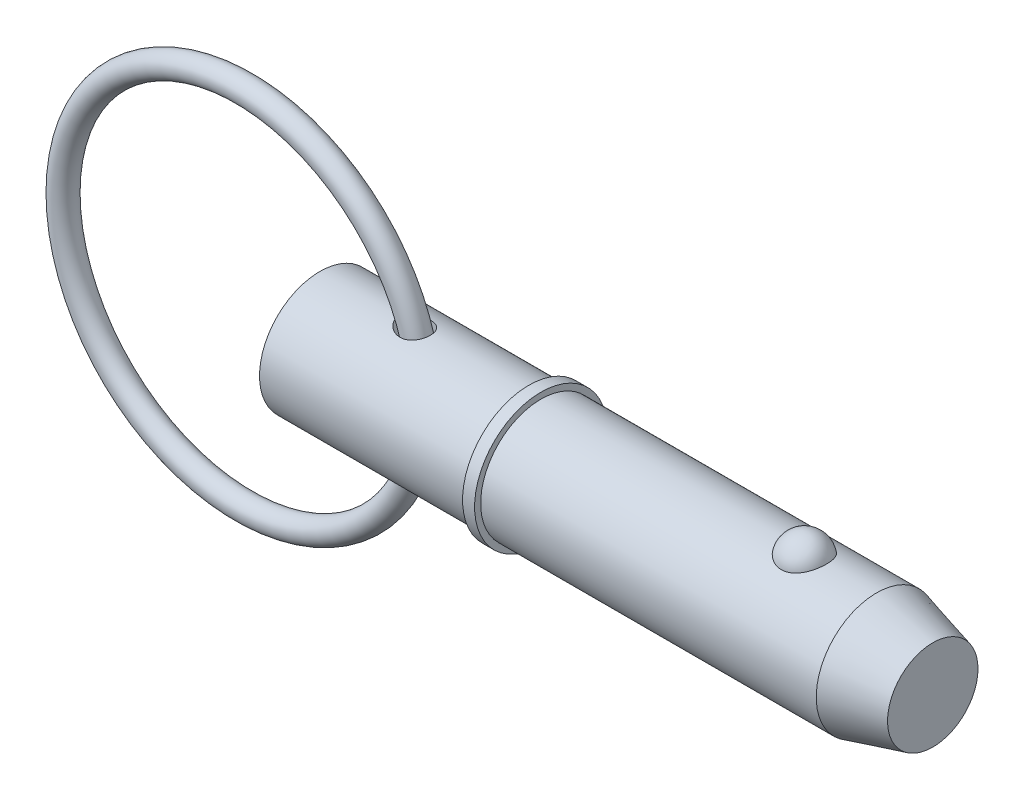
ISO-10303-21;
HEADER;
FILE_DESCRIPTION(('STEP AP214'),'2;1');
FILE_NAME('part.step','',(''),(''),'','','');
FILE_SCHEMA(('AUTOMOTIVE_DESIGN { 1 0 10303 214 1 1 1 1 }'));
ENDSEC;
DATA;
#1=APPLICATION_CONTEXT('core data for automotive mechanical design processes');
#2=APPLICATION_PROTOCOL_DEFINITION('international standard','automotive_design',2000,#1);
#3=PRODUCT_CONTEXT('',#1,'mechanical');
#4=PRODUCT('Part','Part','',(#3));
#5=PRODUCT_RELATED_PRODUCT_CATEGORY('part','',(#4));
#6=PRODUCT_DEFINITION_FORMATION('','',#4);
#7=PRODUCT_DEFINITION_CONTEXT('part definition',#1,'design');
#8=PRODUCT_DEFINITION('design','',#6,#7);
#9=PRODUCT_DEFINITION_SHAPE('','',#8);
#10=(LENGTH_UNIT() NAMED_UNIT(*) SI_UNIT(.MILLI.,.METRE.));
#11=(NAMED_UNIT(*) PLANE_ANGLE_UNIT() SI_UNIT($,.RADIAN.));
#12=(NAMED_UNIT(*) SI_UNIT($,.STERADIAN.) SOLID_ANGLE_UNIT());
#13=UNCERTAINTY_MEASURE_WITH_UNIT(LENGTH_MEASURE(1.E-05),#10,'distance_accuracy_value','');
#14=(GEOMETRIC_REPRESENTATION_CONTEXT(3) GLOBAL_UNCERTAINTY_ASSIGNED_CONTEXT((#13)) GLOBAL_UNIT_ASSIGNED_CONTEXT((#10,
#11,#12)) REPRESENTATION_CONTEXT('',''));
#15=CARTESIAN_POINT('',(0.,0.,0.));
#16=DIRECTION('',(0.,0.,1.));
#17=DIRECTION('',(1.,0.,0.));
#18=AXIS2_PLACEMENT_3D('',#15,#16,#17);
#19=CARTESIAN_POINT('',(-11.9894358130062,0.,0.));
#20=DIRECTION('',(0.,0.,1.));
#21=DIRECTION('',(1.,0.,0.));
#22=AXIS2_PLACEMENT_3D('',#19,#20,#21);
#23=TOROIDAL_SURFACE('',#22,28.575,1.905);
#24=CARTESIAN_POINT('',(18.4905641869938,0.,0.));
#25=VERTEX_POINT('',#24);
#26=VERTEX_LOOP('',#25);
#27=FACE_BOUND('',#26,.T.);
#28=ADVANCED_FACE('P0_F12',(#27),#23,.T.);
#29=CLOSED_SHELL('',(#28));
#30=MANIFOLD_SOLID_BREP('P0_B1',#29);
#31=CARTESIAN_POINT('',(0.,0.,0.));
#32=DIRECTION('',(1.,0.,0.));
#33=DIRECTION('',(0.,0.,-1.));
#34=AXIS2_PLACEMENT_3D('',#31,#32,#33);
#35=CYLINDRICAL_SURFACE('',#34,9.525);
#36=CARTESIAN_POINT('',(12.9513882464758,9.41921920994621,-1.41559473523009));
#37=CARTESIAN_POINT('',(13.0504692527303,9.40163924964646,-1.53256769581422));
#38=CARTESIAN_POINT('',(13.1602600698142,9.38319823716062,-1.6404459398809));
#39=CARTESIAN_POINT('',(13.3966485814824,9.34687220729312,-1.83618480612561));
#40=CARTESIAN_POINT('',(13.5232761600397,9.32898824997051,-1.92400906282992));
#41=CARTESIAN_POINT('',(13.78900694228,9.29593183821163,-2.07784697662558));
#42=CARTESIAN_POINT('',(13.9280753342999,9.28075215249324,-2.14391921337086));
#43=CARTESIAN_POINT('',(14.2153444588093,9.25488828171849,-2.25295850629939));
#44=CARTESIAN_POINT('',(14.3635415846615,9.24420233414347,-2.29593462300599));
#45=CARTESIAN_POINT('',(14.669669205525,9.22859713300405,-2.3579005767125));
#46=CARTESIAN_POINT('',(14.8277567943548,9.22385123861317,-2.37617053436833));
#47=CARTESIAN_POINT('',(15.1447573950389,9.22170813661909,-2.38448481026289));
#48=CARTESIAN_POINT('',(15.3036699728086,9.22430739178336,-2.3745427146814));
#49=CARTESIAN_POINT('',(15.6046561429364,9.2363636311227,-2.32717331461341));
#50=CARTESIAN_POINT('',(15.7470893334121,9.24528216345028,-2.29190131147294));
#51=CARTESIAN_POINT('',(16.0228763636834,9.26842607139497,-2.19642882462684));
#52=CARTESIAN_POINT('',(16.1562346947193,9.28264879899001,-2.1362407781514));
#53=CARTESIAN_POINT('',(16.3991522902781,9.31332263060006,-1.99805318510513));
#54=CARTESIAN_POINT('',(16.5097585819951,9.32951023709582,-1.92182839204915));
#55=CARTESIAN_POINT('',(16.7159974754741,9.36298467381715,-1.75147176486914));
#56=CARTESIAN_POINT('',(16.811631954,9.38027136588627,-1.65734217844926));
#57=CARTESIAN_POINT('',(16.9833240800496,9.41356881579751,-1.45618916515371));
#58=CARTESIAN_POINT('',(17.0597719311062,9.42959946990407,-1.34950141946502));
#59=CARTESIAN_POINT('',(17.1939538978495,9.45905380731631,-1.12462011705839));
#60=CARTESIAN_POINT('',(17.2516877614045,9.4724774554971,-1.00642640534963));
#61=CARTESIAN_POINT('',(17.3474400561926,9.49535683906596,-0.760990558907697));
#62=CARTESIAN_POINT('',(17.3853184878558,9.50478431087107,-0.633691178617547));
#63=CARTESIAN_POINT('',(17.4399027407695,9.51852575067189,-0.374363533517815));
#64=CARTESIAN_POINT('',(17.4566077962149,9.52283953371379,-0.242335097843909));
#65=CARTESIAN_POINT('',(17.4685150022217,9.52590431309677,0.0235692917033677));
#66=CARTESIAN_POINT('',(17.4635842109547,9.52462091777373,0.157451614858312));
#67=CARTESIAN_POINT('',(17.4320243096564,9.5165501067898,0.422467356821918));
#68=CARTESIAN_POINT('',(17.4053947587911,9.50976257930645,0.55360071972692));
#69=CARTESIAN_POINT('',(17.3310009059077,9.49140797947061,0.809490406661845));
#70=CARTESIAN_POINT('',(17.2832204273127,9.47983724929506,0.934241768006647));
#71=CARTESIAN_POINT('',(17.1676219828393,9.453180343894,1.1736825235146));
#72=CARTESIAN_POINT('',(17.0998044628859,9.43809424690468,1.28837214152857));
#73=CARTESIAN_POINT('',(16.9461013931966,9.40614962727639,1.50393386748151));
#74=CARTESIAN_POINT('',(16.8602910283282,9.38929862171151,1.6048606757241));
#75=CARTESIAN_POINT('',(16.6726759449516,9.35566510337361,1.79055313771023));
#76=CARTESIAN_POINT('',(16.5708731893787,9.33888258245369,1.87532077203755));
#77=CARTESIAN_POINT('',(16.3550631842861,9.30741331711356,2.02572386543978));
#78=CARTESIAN_POINT('',(16.2411701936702,9.29270956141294,2.09151983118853));
#79=CARTESIAN_POINT('',(16.0037488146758,9.26681293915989,2.20343355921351));
#80=CARTESIAN_POINT('',(15.8802207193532,9.25561996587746,2.24955191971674));
#81=CARTESIAN_POINT('',(15.6262451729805,9.23779438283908,2.32167613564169));
#82=CARTESIAN_POINT('',(15.4957570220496,9.23119272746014,2.34754561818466));
#83=CARTESIAN_POINT('',(15.2322153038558,9.22318493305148,2.37881082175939));
#84=CARTESIAN_POINT('',(15.0991611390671,9.22178001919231,2.38420171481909));
#85=CARTESIAN_POINT('',(14.8267609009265,9.22414647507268,2.37503099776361));
#86=CARTESIAN_POINT('',(14.6874545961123,9.22819578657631,2.35939810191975));
#87=CARTESIAN_POINT('',(14.412976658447,9.24129253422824,2.30756034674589));
#88=CARTESIAN_POINT('',(14.2778066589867,9.25034191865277,2.27134746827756));
#89=CARTESIAN_POINT('',(14.0027915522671,9.27334688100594,2.1756145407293));
#90=CARTESIAN_POINT('',(13.8635960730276,9.28766658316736,2.11431132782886));
#91=CARTESIAN_POINT('',(13.5969045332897,9.31925368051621,1.97041856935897));
#92=CARTESIAN_POINT('',(13.4694182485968,9.33652350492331,1.88781145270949));
#93=CARTESIAN_POINT('',(13.2243568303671,9.37286659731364,1.69844580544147));
#94=CARTESIAN_POINT('',(13.1075060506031,9.39198626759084,1.59075211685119));
#95=CARTESIAN_POINT('',(12.8957171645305,9.42881110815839,1.35544651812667));
#96=CARTESIAN_POINT('',(12.8007455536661,9.44651841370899,1.22786557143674));
#97=CARTESIAN_POINT('',(12.6580495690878,9.4741137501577,0.9887243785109));
#98=CARTESIAN_POINT('',(12.604453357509,9.4848570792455,0.880756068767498));
#99=CARTESIAN_POINT('',(12.515693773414,9.50295777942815,0.657225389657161));
#100=CARTESIAN_POINT('',(12.4805142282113,9.51031812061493,0.541669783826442));
#101=CARTESIAN_POINT('',(12.4305797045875,9.52083647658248,0.305475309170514));
#102=CARTESIAN_POINT('',(12.4159122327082,9.52397648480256,0.18481691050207));
#103=CARTESIAN_POINT('',(12.408320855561,9.52559626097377,-0.0572308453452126));
#104=CARTESIAN_POINT('',(12.4153963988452,9.52407614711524,-0.178620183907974));
#105=CARTESIAN_POINT('',(12.4495068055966,9.51684301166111,-0.409566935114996));
#106=CARTESIAN_POINT('',(12.4750931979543,9.51143444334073,-0.519353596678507));
#107=CARTESIAN_POINT('',(12.543120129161,9.49733710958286,-0.73328523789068));
#108=CARTESIAN_POINT('',(12.5855568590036,9.4886490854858,-0.837431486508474));
#109=CARTESIAN_POINT('',(12.6780792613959,9.47023833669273,-1.02356028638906));
#110=CARTESIAN_POINT('',(12.7261842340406,9.46084463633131,-1.10657511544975));
#111=CARTESIAN_POINT('',(12.8319313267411,9.44081892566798,-1.26610577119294));
#112=CARTESIAN_POINT('',(12.8895756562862,9.43018662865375,-1.34262008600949));
#113=CARTESIAN_POINT('',(12.9513882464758,9.41921920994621,-1.41559473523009));
#114=B_SPLINE_CURVE_WITH_KNOTS('',3,(#36,#37,#38,#39,#40,#41,#42,#43,#44,#45,#46,#47,#48,#49,
#50,#51,#52,#53,#54,#55,#56,#57,#58,#59,#60,#61,#62,#63,#64,#65,#66,#67,#68,#69,#70,#71,#72,#73,
#74,#75,#76,#77,#78,#79,#80,#81,#82,#83,#84,#85,#86,#87,#88,#89,#90,#91,#92,#93,#94,#95,#96,#97,
#98,#99,#100,#101,#102,#103,#104,#105,#106,#107,#108,#109,#110,#111,#112,#113),.UNSPECIFIED.,
.T.,.F.,(4,2,2,2,2,2,2,2,2,2,2,2,2,2,2,2,2,2,2,2,2,2,2,2,2,2,2,2,2,2,2,2,2,2,2,2,2,2,4),(0.,
0.462524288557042,0.925880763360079,1.3879789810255,1.8498957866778,2.3250010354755,
2.79987752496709,3.23851602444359,3.67693583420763,4.08084875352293,4.48471100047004,
4.87953549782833,5.27436531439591,5.67194282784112,6.0695347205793,6.46957303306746,
6.86961947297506,7.26997240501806,7.67031642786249,8.06901977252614,8.46767421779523,
8.86284969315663,9.25801315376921,9.65581560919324,10.0537118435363,10.4726706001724,
10.8917927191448,11.3481090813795,11.8048030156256,12.2824769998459,12.7594145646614,
13.1209614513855,13.4821903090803,13.8449555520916,14.2077115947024,14.5447865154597,
14.881785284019,15.170268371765,15.4588183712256),.UNSPECIFIED.);
#115=CARTESIAN_POINT('',(12.9513882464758,9.41921920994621,-1.41559473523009));
#116=VERTEX_POINT('',#115);
#117=EDGE_CURVE('P1_E42',#116,#116,#114,.T.);
#118=ORIENTED_EDGE('',*,*,#117,.T.);
#119=EDGE_LOOP('',(#118));
#120=FACE_BOUND('',#119,.T.);
#121=CARTESIAN_POINT('',(0.,0.,0.));
#122=DIRECTION('',(1.,0.,0.));
#123=DIRECTION('',(0.,0.,-1.));
#124=AXIS2_PLACEMENT_3D('',#121,#122,#123);
#125=CIRCLE('',#124,9.525);
#126=CARTESIAN_POINT('',(0.,0.,-9.525));
#127=VERTEX_POINT('',#126);
#128=EDGE_CURVE('P1_E9',#127,#127,#125,.T.);
#129=ORIENTED_EDGE('',*,*,#128,.T.);
#130=EDGE_LOOP('',(#129));
#131=FACE_BOUND('',#130,.T.);
#132=CARTESIAN_POINT('',(33.025,0.,0.));
#133=DIRECTION('',(1.,0.,0.));
#134=DIRECTION('',(0.,0.,-1.));
#135=AXIS2_PLACEMENT_3D('',#132,#133,#134);
#136=CIRCLE('',#135,9.525);
#137=CARTESIAN_POINT('',(33.025,0.,-9.525));
#138=VERTEX_POINT('',#137);
#139=EDGE_CURVE('P1_E25',#138,#138,#136,.T.);
#140=ORIENTED_EDGE('',*,*,#139,.F.);
#141=EDGE_LOOP('',(#140));
#142=FACE_BOUND('',#141,.T.);
#143=CARTESIAN_POINT('',(12.9513882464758,-9.41921920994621,-1.41559473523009));
#144=CARTESIAN_POINT('',(12.8706569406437,-9.43354320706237,-1.32028288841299));
#145=CARTESIAN_POINT('',(12.7970077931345,-9.44729974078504,-1.21890449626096));
#146=CARTESIAN_POINT('',(12.6667099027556,-9.47239055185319,-1.00546491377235));
#147=CARTESIAN_POINT('',(12.6100480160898,-9.48372669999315,-0.893412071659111));
#148=CARTESIAN_POINT('',(12.5163428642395,-9.50281544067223,-0.66020233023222));
#149=CARTESIAN_POINT('',(12.4794216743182,-9.51054569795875,-0.538993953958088));
#150=CARTESIAN_POINT('',(12.4282252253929,-9.52133525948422,-0.29167282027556));
#151=CARTESIAN_POINT('',(12.4139371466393,-9.52439720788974,-0.165562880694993));
#152=CARTESIAN_POINT('',(12.4092595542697,-9.52539668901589,0.0763263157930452));
#153=CARTESIAN_POINT('',(12.4169377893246,-9.5237485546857,0.192070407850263));
#154=CARTESIAN_POINT('',(12.4515961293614,-9.51640070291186,0.420478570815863));
#155=CARTESIAN_POINT('',(12.4785770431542,-9.51070081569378,0.533142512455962));
#156=CARTESIAN_POINT('',(12.5496371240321,-9.49599978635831,0.750537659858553));
#157=CARTESIAN_POINT('',(12.5934215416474,-9.48705569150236,0.855370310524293));
#158=CARTESIAN_POINT('',(12.6960201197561,-9.46670226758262,1.05710432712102));
#159=CARTESIAN_POINT('',(12.754838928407,-9.45529217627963,1.15400322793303));
#160=CARTESIAN_POINT('',(12.8926588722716,-9.42958102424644,1.34883014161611));
#161=CARTESIAN_POINT('',(12.9731843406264,-9.41509922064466,1.44565277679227));
#162=CARTESIAN_POINT('',(13.1473692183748,-9.38554264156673,1.62653953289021));
#163=CARTESIAN_POINT('',(13.2410364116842,-9.37046751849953,1.71059603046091));
#164=CARTESIAN_POINT('',(13.4543924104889,-9.33867330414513,1.87697964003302));
#165=CARTESIAN_POINT('',(13.5758667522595,-9.32205896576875,1.95704323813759));
#166=CARTESIAN_POINT('',(13.8299208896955,-9.29140277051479,2.09777392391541));
#167=CARTESIAN_POINT('',(13.9625074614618,-9.27736250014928,2.15842906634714));
#168=CARTESIAN_POINT('',(14.2477938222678,-9.25234849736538,2.26337318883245));
#169=CARTESIAN_POINT('',(14.4012368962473,-9.2417532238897,2.30575283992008));
#170=CARTESIAN_POINT('',(14.7134258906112,-9.22706044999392,2.36387471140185));
#171=CARTESIAN_POINT('',(14.8721705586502,-9.22296142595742,2.37962317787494));
#172=CARTESIAN_POINT('',(15.1841930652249,-9.22219798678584,2.38258156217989));
#173=CARTESIAN_POINT('',(15.3374581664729,-9.22526675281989,2.37081567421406));
#174=CARTESIAN_POINT('',(15.6390558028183,-9.23821642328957,2.31984408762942));
#175=CARTESIAN_POINT('',(15.7873916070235,-9.24809271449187,2.28065697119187));
#176=CARTESIAN_POINT('',(16.0605055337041,-9.27231045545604,2.17997072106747));
#177=CARTESIAN_POINT('',(16.1861988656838,-9.28616347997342,2.12082794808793));
#178=CARTESIAN_POINT('',(16.4248737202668,-9.31689725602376,1.9814435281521));
#179=CARTESIAN_POINT('',(16.5378583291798,-9.33377726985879,1.90120701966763));
#180=CARTESIAN_POINT('',(16.7424913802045,-9.36766057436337,1.72629138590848));
#181=CARTESIAN_POINT('',(16.8349077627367,-9.38461836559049,1.63249912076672));
#182=CARTESIAN_POINT('',(17.0025959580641,-9.41752009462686,1.43052052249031));
#183=CARTESIAN_POINT('',(17.0778684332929,-9.43346407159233,1.32233474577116));
#184=CARTESIAN_POINT('',(17.2093311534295,-9.46256896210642,1.09477833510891));
#185=CARTESIAN_POINT('',(17.2655443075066,-9.47573320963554,0.975421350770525));
#186=CARTESIAN_POINT('',(17.3577240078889,-9.49788660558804,0.728764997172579));
#187=CARTESIAN_POINT('',(17.3936897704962,-9.5068755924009,0.601465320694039));
#188=CARTESIAN_POINT('',(17.4447894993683,-9.51977728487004,0.341392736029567));
#189=CARTESIAN_POINT('',(17.4597470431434,-9.52364698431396,0.208583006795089));
#190=CARTESIAN_POINT('',(17.467935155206,-9.52575588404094,-0.0577507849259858));
#191=CARTESIAN_POINT('',(17.4611651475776,-9.52399493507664,-0.191274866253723));
#192=CARTESIAN_POINT('',(17.4259933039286,-9.51501704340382,-0.455658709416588));
#193=CARTESIAN_POINT('',(17.3975278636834,-9.50778405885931,-0.586509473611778));
#194=CARTESIAN_POINT('',(17.3195245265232,-9.48862442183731,-0.841413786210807));
#195=CARTESIAN_POINT('',(17.2699864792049,-9.47669773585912,-0.965467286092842));
#196=CARTESIAN_POINT('',(17.1510794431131,-9.44947793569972,-1.20302860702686));
#197=CARTESIAN_POINT('',(17.0817421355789,-9.43419020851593,-1.31655289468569));
#198=CARTESIAN_POINT('',(16.9249035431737,-9.40193593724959,-1.52999797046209));
#199=CARTESIAN_POINT('',(16.8374037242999,-9.38496952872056,-1.62991985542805));
#200=CARTESIAN_POINT('',(16.6472525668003,-9.35139745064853,-1.81261591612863));
#201=CARTESIAN_POINT('',(16.544718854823,-9.33479003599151,-1.89551219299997));
#202=CARTESIAN_POINT('',(16.3268885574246,-9.30366076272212,-2.04284430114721));
#203=CARTESIAN_POINT('',(16.2115933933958,-9.28913867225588,-2.10728218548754));
#204=CARTESIAN_POINT('',(15.9721327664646,-9.26380878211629,-2.21598517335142));
#205=CARTESIAN_POINT('',(15.8480095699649,-9.25298455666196,-2.26033977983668));
#206=CARTESIAN_POINT('',(15.5939970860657,-9.23601616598,-2.32870721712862));
#207=CARTESIAN_POINT('',(15.4641070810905,-9.22987258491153,-2.35271750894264));
#208=CARTESIAN_POINT('',(15.1982340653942,-9.22261892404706,-2.38099747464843));
#209=CARTESIAN_POINT('',(15.0621840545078,-9.22166165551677,-2.38466791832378));
#210=CARTESIAN_POINT('',(14.7911713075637,-9.22504733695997,-2.37153091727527));
#211=CARTESIAN_POINT('',(14.6562088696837,-9.2293916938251,-2.35471803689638));
#212=CARTESIAN_POINT('',(14.3799999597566,-9.24325361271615,-2.29972931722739));
#213=CARTESIAN_POINT('',(14.2390842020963,-9.25314817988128,-2.2599897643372));
#214=CARTESIAN_POINT('',(13.9651910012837,-9.27709186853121,-2.15959208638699));
#215=CARTESIAN_POINT('',(13.8322212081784,-9.29114491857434,-2.09891417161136));
#216=CARTESIAN_POINT('',(13.5621642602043,-9.32369066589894,-1.94960068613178));
#217=CARTESIAN_POINT('',(13.4264724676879,-9.34251276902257,-1.85849626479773));
#218=CARTESIAN_POINT('',(13.1736579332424,-9.38095091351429,-1.6535412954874));
#219=CARTESIAN_POINT('',(13.0565182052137,-9.40056620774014,-1.53971177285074));
#220=CARTESIAN_POINT('',(12.9513882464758,-9.41921920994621,-1.41559473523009));
#221=B_SPLINE_CURVE_WITH_KNOTS('',3,(#143,#144,#145,#146,#147,#148,#149,#150,#151,#152,#153,
#154,#155,#156,#157,#158,#159,#160,#161,#162,#163,#164,#165,#166,#167,#168,#169,#170,#171,#172,
#173,#174,#175,#176,#177,#178,#179,#180,#181,#182,#183,#184,#185,#186,#187,#188,#189,#190,#191,
#192,#193,#194,#195,#196,#197,#198,#199,#200,#201,#202,#203,#204,#205,#206,#207,#208,#209,#210,
#211,#212,#213,#214,#215,#216,#217,#218,#219,#220),.UNSPECIFIED.,.T.,.F.,(4,2,2,2,2,2,2,2,2,2,2,
2,2,2,2,2,2,2,2,2,2,2,2,2,2,2,2,2,2,2,2,2,2,2,2,2,2,2,4),(0.,0.376746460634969,0.75320065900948,
1.13195666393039,1.51049805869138,1.85679105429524,2.20309856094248,2.54359033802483,
2.88418751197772,3.26301611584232,3.64207005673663,4.07954912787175,4.51729693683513,
4.99355673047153,5.46970480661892,5.92841231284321,6.38680927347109,6.80346940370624,
7.22002812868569,7.61642768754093,8.01281192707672,8.40871801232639,8.80463942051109,
9.20386620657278,9.60310357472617,10.0035159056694,10.4039310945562,10.8037091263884,
11.2034549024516,11.6002252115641,11.9969513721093,12.3918916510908,12.7868812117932,
13.1934480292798,13.6001227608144,14.038511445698,14.4773156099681,14.9683748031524,
15.4589817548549),.UNSPECIFIED.);
#222=CARTESIAN_POINT('',(12.9513882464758,-9.41921920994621,-1.41559473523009));
#223=VERTEX_POINT('',#222);
#224=EDGE_CURVE('P1_E17',#223,#223,#221,.T.);
#225=ORIENTED_EDGE('',*,*,#224,.T.);
#226=EDGE_LOOP('',(#225));
#227=FACE_BOUND('',#226,.T.);
#228=ADVANCED_FACE('P1_F13',(#120,#131,#142,#227),#35,.T.);
#229=CARTESIAN_POINT('',(0.,0.,0.));
#230=DIRECTION('',(1.,0.,0.));
#231=DIRECTION('',(0.,0.,-1.));
#232=AXIS2_PLACEMENT_3D('',#229,#230,#231);
#233=CYLINDRICAL_SURFACE('',#232,9.525);
#234=CARTESIAN_POINT('',(87.9430540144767,0.,0.));
#235=DIRECTION('',(1.,0.,0.));
#236=DIRECTION('',(0.,0.,-1.));
#237=AXIS2_PLACEMENT_3D('',#234,#235,#236);
#238=CIRCLE('',#237,9.525);
#239=CARTESIAN_POINT('',(87.9430540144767,0.,-9.525));
#240=VERTEX_POINT('',#239);
#241=EDGE_CURVE('P1_E99',#240,#240,#238,.T.);
#242=ORIENTED_EDGE('',*,*,#241,.F.);
#243=EDGE_LOOP('',(#242));
#244=FACE_BOUND('',#243,.T.);
#245=CARTESIAN_POINT('',(34.93,0.,0.));
#246=DIRECTION('',(1.,0.,0.));
#247=DIRECTION('',(0.,0.,-1.));
#248=AXIS2_PLACEMENT_3D('',#245,#246,#247);
#249=CIRCLE('',#248,9.525);
#250=CARTESIAN_POINT('',(34.93,0.,-9.525));
#251=VERTEX_POINT('',#250);
#252=EDGE_CURVE('P1_E96',#251,#251,#249,.T.);
#253=ORIENTED_EDGE('',*,*,#252,.T.);
#254=EDGE_LOOP('',(#253));
#255=FACE_BOUND('',#254,.T.);
#256=CARTESIAN_POINT('',(76.5457573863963,8.80405803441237,3.63513233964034));
#257=CARTESIAN_POINT('',(76.4516766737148,8.80405953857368,3.63513053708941));
#258=CARTESIAN_POINT('',(76.3575618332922,8.80561325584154,3.63137461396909));
#259=CARTESIAN_POINT('',(76.1700126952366,8.81177748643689,3.61638665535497));
#260=CARTESIAN_POINT('',(76.0765788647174,8.81638992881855,3.60514990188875));
#261=CARTESIAN_POINT('',(75.7979452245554,8.83467114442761,3.56024627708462));
#262=CARTESIAN_POINT('',(75.6146916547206,8.85278327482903,3.5153862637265));
#263=CARTESIAN_POINT('',(75.259509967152,8.89871214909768,3.39742145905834));
#264=CARTESIAN_POINT('',(75.0875533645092,8.92650327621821,3.32439116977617));
#265=CARTESIAN_POINT('',(74.758707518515,8.98874819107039,3.15220244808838));
#266=CARTESIAN_POINT('',(74.6018114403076,9.02319893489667,3.05305594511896));
#267=CARTESIAN_POINT('',(74.3022147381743,9.09629186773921,2.82797815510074));
#268=CARTESIAN_POINT('',(74.1600600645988,9.13502685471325,2.70135138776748));
#269=CARTESIAN_POINT('',(73.8982999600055,9.2118657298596,2.42641932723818));
#270=CARTESIAN_POINT('',(73.7787015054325,9.24996941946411,2.27810735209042));
#271=CARTESIAN_POINT('',(73.559645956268,9.32341082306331,1.95652290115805));
#272=CARTESIAN_POINT('',(73.4613174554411,9.35855090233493,1.78243511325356));
#273=CARTESIAN_POINT('',(73.2938190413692,9.42045142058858,1.41937246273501));
#274=CARTESIAN_POINT('',(73.2246511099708,9.44721128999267,1.23039658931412));
#275=CARTESIAN_POINT('',(73.1161994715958,9.48990641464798,0.84037088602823));
#276=CARTESIAN_POINT('',(73.0772880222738,9.50570658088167,0.639202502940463));
#277=CARTESIAN_POINT('',(73.0315550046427,9.52433146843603,0.23266436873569));
#278=CARTESIAN_POINT('',(73.0247324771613,9.52715657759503,0.0272947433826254));
#279=CARTESIAN_POINT('',(73.043255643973,9.51956918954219,-0.380478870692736));
#280=CARTESIAN_POINT('',(73.0684052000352,9.50923740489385,-0.582893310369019));
#281=CARTESIAN_POINT('',(73.1500253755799,9.47651897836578,-0.980293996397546));
#282=CARTESIAN_POINT('',(73.2064966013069,9.45413210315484,-1.17528009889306));
#283=CARTESIAN_POINT('',(73.3497192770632,9.39954044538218,-1.55263697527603));
#284=CARTESIAN_POINT('',(73.4365124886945,9.36732213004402,-1.73498993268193));
#285=CARTESIAN_POINT('',(73.6386103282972,9.29640700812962,-2.08177763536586));
#286=CARTESIAN_POINT('',(73.7539172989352,9.25770966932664,-2.24621090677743));
#287=CARTESIAN_POINT('',(74.011264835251,9.17775604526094,-2.5533833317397));
#288=CARTESIAN_POINT('',(74.1534344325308,9.136488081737,-2.696011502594));
#289=CARTESIAN_POINT('',(74.46089985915,9.05620497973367,-2.95451229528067));
#290=CARTESIAN_POINT('',(74.626193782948,9.01718965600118,-3.070387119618));
#291=CARTESIAN_POINT('',(74.972052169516,8.94680019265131,-3.26976836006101));
#292=CARTESIAN_POINT('',(75.1522278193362,8.91528408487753,-3.353897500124));
#293=CARTESIAN_POINT('',(75.5256514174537,8.86272514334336,-3.49043503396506));
#294=CARTESIAN_POINT('',(75.718894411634,8.84167836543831,-3.54285537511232));
#295=CARTESIAN_POINT('',(76.1025036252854,8.81348056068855,-3.61241306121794));
#296=CARTESIAN_POINT('',(76.2925251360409,8.80568348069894,-3.6311933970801));
#297=CARTESIAN_POINT('',(76.6731906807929,8.80289410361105,-3.63795342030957));
#298=CARTESIAN_POINT('',(76.8638345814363,8.80789922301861,-3.62593932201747));
#299=CARTESIAN_POINT('',(77.234007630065,8.82974915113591,-3.57238430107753));
#300=CARTESIAN_POINT('',(77.4136976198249,8.84621463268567,-3.53178890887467));
#301=CARTESIAN_POINT('',(77.7634226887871,8.88875330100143,-3.42331083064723));
#302=CARTESIAN_POINT('',(77.9334569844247,8.91482726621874,-3.35542593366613));
#303=CARTESIAN_POINT('',(78.2632377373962,8.97448239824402,-3.19248225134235));
#304=CARTESIAN_POINT('',(78.4226801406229,9.00821446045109,-3.0968647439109));
#305=CARTESIAN_POINT('',(78.7235136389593,9.07935398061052,-2.88162736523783));
#306=CARTESIAN_POINT('',(78.8649005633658,9.11676228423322,-2.76200196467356));
#307=CARTESIAN_POINT('',(79.1333193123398,9.19347419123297,-2.49516285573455));
#308=CARTESIAN_POINT('',(79.2592750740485,9.23277872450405,-2.34686614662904));
#309=CARTESIAN_POINT('',(79.4855227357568,9.3073761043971,-2.03093683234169));
#310=CARTESIAN_POINT('',(79.5858100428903,9.34266823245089,-1.86330077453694));
#311=CARTESIAN_POINT('',(79.7615149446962,9.40674710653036,-1.50744893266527));
#312=CARTESIAN_POINT('',(79.836041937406,9.43529176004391,-1.31874876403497));
#313=CARTESIAN_POINT('',(79.9541650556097,9.48144132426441,-0.930631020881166));
#314=CARTESIAN_POINT('',(79.9977608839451,9.49904612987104,-0.73121334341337));
#315=CARTESIAN_POINT('',(80.0531580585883,9.5215314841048,-0.327147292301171));
#316=CARTESIAN_POINT('',(80.0649354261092,9.52640243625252,-0.12249509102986));
#317=CARTESIAN_POINT('',(80.0563825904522,9.5228957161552,0.286018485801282));
#318=CARTESIAN_POINT('',(80.0360530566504,9.5145183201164,0.489879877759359));
#319=CARTESIAN_POINT('',(79.9638840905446,9.48544083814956,0.889994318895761));
#320=CARTESIAN_POINT('',(79.9121993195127,9.46480124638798,1.08627971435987));
#321=CARTESIAN_POINT('',(79.7784917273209,9.41333895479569,1.46682086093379));
#322=CARTESIAN_POINT('',(79.6964668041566,9.38251554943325,1.65107577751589));
#323=CARTESIAN_POINT('',(79.5031929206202,9.31365636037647,2.00346348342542));
#324=CARTESIAN_POINT('',(79.3917838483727,9.27558138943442,2.17150083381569));
#325=CARTESIAN_POINT('',(79.1422947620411,9.19638714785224,2.48563115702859));
#326=CARTESIAN_POINT('',(79.0042163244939,9.15526805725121,2.63172542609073));
#327=CARTESIAN_POINT('',(78.7048438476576,9.07465393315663,2.89750997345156));
#328=CARTESIAN_POINT('',(78.5436109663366,9.03515496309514,3.01726776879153));
#329=CARTESIAN_POINT('',(78.2016136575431,8.96227564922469,3.22732920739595));
#330=CARTESIAN_POINT('',(78.020841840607,8.92889763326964,3.31762165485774));
#331=CARTESIAN_POINT('',(77.6514451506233,8.8734538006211,3.46314419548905));
#332=CARTESIAN_POINT('',(77.4633237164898,8.85102983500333,3.51950082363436));
#333=CARTESIAN_POINT('',(77.1757869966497,8.8266696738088,3.57993683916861));
#334=CARTESIAN_POINT('',(77.0791339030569,8.82009725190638,3.5960621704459));
#335=CARTESIAN_POINT('',(76.8846770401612,8.81020897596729,3.62022512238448));
#336=CARTESIAN_POINT('',(76.7868741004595,8.80689090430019,3.62826825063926));
#337=CARTESIAN_POINT('',(76.6412243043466,8.80445615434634,3.63416760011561));
#338=CARTESIAN_POINT('',(76.5934952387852,8.80405727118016,3.63513325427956));
#339=CARTESIAN_POINT('',(76.5457573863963,8.80405803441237,3.63513233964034));
#340=B_SPLINE_CURVE_WITH_KNOTS('',3,(#256,#257,#258,#259,#260,#261,#262,#263,#264,#265,#266,
#267,#268,#269,#270,#271,#272,#273,#274,#275,#276,#277,#278,#279,#280,#281,#282,#283,#284,#285,
#286,#287,#288,#289,#290,#291,#292,#293,#294,#295,#296,#297,#298,#299,#300,#301,#302,#303,#304,
#305,#306,#307,#308,#309,#310,#311,#312,#313,#314,#315,#316,#317,#318,#319,#320,#321,#322,#323,
#324,#325,#326,#327,#328,#329,#330,#331,#332,#333,#334,#335,#336,#337,#338,#339),.UNSPECIFIED.,
.T.,.F.,(4,2,2,2,2,2,2,2,2,2,2,2,2,2,2,2,2,2,2,2,2,2,2,2,2,2,2,2,2,2,2,2,2,2,2,2,2,2,2,2,2,4),
(0.,0.282202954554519,0.564584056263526,1.13017050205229,1.69427128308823,2.25811483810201,
2.83836627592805,3.4187968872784,4.02497117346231,4.63118665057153,5.24474754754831,
5.85829010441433,6.46808687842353,7.07789545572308,7.68854723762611,8.29924920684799,
8.9129628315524,9.52662591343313,10.1275338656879,10.7282152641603,11.2986646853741,
11.8689989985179,12.4213015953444,12.973648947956,13.5380053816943,14.1024919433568,
14.695298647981,15.2882113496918,15.8999469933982,16.5116885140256,17.1238909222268,
17.7360805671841,18.3452748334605,18.9545113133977,19.567138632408,20.179729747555,
20.7907316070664,21.4019653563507,21.9915938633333,22.2859053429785,22.5800161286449,
22.7232098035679),.UNSPECIFIED.);
#341=CARTESIAN_POINT('',(76.5457573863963,8.80405803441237,3.63513233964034));
#342=VERTEX_POINT('',#341);
#343=EDGE_CURVE('P1_E34',#342,#342,#340,.T.);
#344=ORIENTED_EDGE('',*,*,#343,.T.);
#345=EDGE_LOOP('',(#344));
#346=FACE_BOUND('',#345,.T.);
#347=ADVANCED_FACE('P1_F46',(#244,#255,#346),#233,.T.);
#348=CARTESIAN_POINT('',(0.,0.,0.));
#349=DIRECTION('',(-1.,0.,0.));
#350=DIRECTION('',(0.,0.,1.));
#351=AXIS2_PLACEMENT_3D('',#348,#349,#350);
#352=PLANE('',#351);
#353=ORIENTED_EDGE('',*,*,#128,.F.);
#354=EDGE_LOOP('',(#353));
#355=FACE_BOUND('',#354,.T.);
#356=ADVANCED_FACE('P1_F15',(#355),#352,.T.);
#357=CARTESIAN_POINT('',(33.025,9.525,0.));
#358=DIRECTION('',(-1.,0.,0.));
#359=DIRECTION('',(0.,0.,1.));
#360=AXIS2_PLACEMENT_3D('',#357,#358,#359);
#361=PLANE('',#360);
#362=ORIENTED_EDGE('',*,*,#139,.T.);
#363=EDGE_LOOP('',(#362));
#364=FACE_BOUND('',#363,.T.);
#365=CARTESIAN_POINT('',(33.025,0.,0.));
#366=DIRECTION('',(1.,0.,0.));
#367=DIRECTION('',(0.,0.,-1.));
#368=AXIS2_PLACEMENT_3D('',#365,#366,#367);
#369=CIRCLE('',#368,10.4775);
#370=CARTESIAN_POINT('',(33.025,0.,-10.4775));
#371=VERTEX_POINT('',#370);
#372=EDGE_CURVE('P1_E30',#371,#371,#369,.T.);
#373=ORIENTED_EDGE('',*,*,#372,.F.);
#374=EDGE_LOOP('',(#373));
#375=FACE_BOUND('',#374,.T.);
#376=ADVANCED_FACE('P1_F81',(#364,#375),#361,.T.);
#377=CARTESIAN_POINT('',(0.,0.,0.));
#378=DIRECTION('',(1.,0.,0.));
#379=DIRECTION('',(0.,0.,-1.));
#380=AXIS2_PLACEMENT_3D('',#377,#378,#379);
#381=CYLINDRICAL_SURFACE('',#380,10.4775);
#382=ORIENTED_EDGE('',*,*,#372,.T.);
#383=EDGE_LOOP('',(#382));
#384=FACE_BOUND('',#383,.T.);
#385=CARTESIAN_POINT('',(34.93,0.,0.));
#386=DIRECTION('',(1.,0.,0.));
#387=DIRECTION('',(0.,0.,-1.));
#388=AXIS2_PLACEMENT_3D('',#385,#386,#387);
#389=CIRCLE('',#388,10.4775);
#390=CARTESIAN_POINT('',(34.93,0.,-10.4775));
#391=VERTEX_POINT('',#390);
#392=EDGE_CURVE('P1_E95',#391,#391,#389,.T.);
#393=ORIENTED_EDGE('',*,*,#392,.F.);
#394=EDGE_LOOP('',(#393));
#395=FACE_BOUND('',#394,.T.);
#396=ADVANCED_FACE('P1_F68',(#384,#395),#381,.T.);
#397=CARTESIAN_POINT('',(34.93,10.4775,0.));
#398=DIRECTION('',(1.,0.,0.));
#399=DIRECTION('',(0.,0.,-1.));
#400=AXIS2_PLACEMENT_3D('',#397,#398,#399);
#401=PLANE('',#400);
#402=ORIENTED_EDGE('',*,*,#392,.T.);
#403=EDGE_LOOP('',(#402));
#404=FACE_BOUND('',#403,.T.);
#405=ORIENTED_EDGE('',*,*,#252,.F.);
#406=EDGE_LOOP('',(#405));
#407=FACE_BOUND('',#406,.T.);
#408=ADVANCED_FACE('P1_F62',(#404,#407),#401,.T.);
#409=CARTESIAN_POINT('',(96.83,0.,0.));
#410=DIRECTION('',(-1.,0.,0.));
#411=DIRECTION('',(0.,0.,1.));
#412=AXIS2_PLACEMENT_3D('',#409,#410,#411);
#413=CONICAL_SURFACE('',#412,7.14375000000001,0.26179938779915);
#414=ORIENTED_EDGE('',*,*,#241,.T.);
#415=EDGE_LOOP('',(#414));
#416=FACE_BOUND('',#415,.T.);
#417=CARTESIAN_POINT('',(96.83,0.,0.));
#418=DIRECTION('',(1.,0.,0.));
#419=DIRECTION('',(0.,0.,-1.));
#420=AXIS2_PLACEMENT_3D('',#417,#418,#419);
#421=CIRCLE('',#420,7.14375000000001);
#422=CARTESIAN_POINT('',(96.83,0.,-7.14375000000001));
#423=VERTEX_POINT('',#422);
#424=EDGE_CURVE('P1_E41',#423,#423,#421,.T.);
#425=ORIENTED_EDGE('',*,*,#424,.F.);
#426=EDGE_LOOP('',(#425));
#427=FACE_BOUND('',#426,.T.);
#428=ADVANCED_FACE('P1_F59',(#416,#427),#413,.T.);
#429=CARTESIAN_POINT('',(96.83,7.14375000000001,0.));
#430=DIRECTION('',(1.,0.,0.));
#431=DIRECTION('',(0.,0.,-1.));
#432=AXIS2_PLACEMENT_3D('',#429,#430,#431);
#433=PLANE('',#432);
#434=ORIENTED_EDGE('',*,*,#424,.T.);
#435=EDGE_LOOP('',(#434));
#436=FACE_BOUND('',#435,.T.);
#437=ADVANCED_FACE('P1_F55',(#436),#433,.T.);
#438=CARTESIAN_POINT('',(76.5457573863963,8.5725,0.));
#439=DIRECTION('',(-1.,0.,0.));
#440=DIRECTION('',(0.,-1.,0.));
#441=AXIS2_PLACEMENT_3D('',#438,#439,#440);
#442=SPHERICAL_SURFACE('',#441,3.64249999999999);
#443=ORIENTED_EDGE('',*,*,#343,.F.);
#444=EDGE_LOOP('',(#443));
#445=FACE_BOUND('',#444,.T.);
#446=ADVANCED_FACE('P1_F50',(#445),#442,.T.);
#447=CARTESIAN_POINT('',(-11.9894358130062,0.,0.));
#448=DIRECTION('',(0.,0.,1.));
#449=DIRECTION('',(1.,0.,0.));
#450=AXIS2_PLACEMENT_3D('',#447,#448,#449);
#451=TOROIDAL_SURFACE('',#450,28.575,2.38125);
#452=ORIENTED_EDGE('',*,*,#224,.F.);
#453=EDGE_LOOP('',(#452));
#454=FACE_BOUND('',#453,.T.);
#455=ORIENTED_EDGE('',*,*,#117,.F.);
#456=EDGE_LOOP('',(#455));
#457=FACE_BOUND('',#456,.T.);
#458=ADVANCED_FACE('P1_F54',(#454,#457),#451,.F.);
#459=CLOSED_SHELL('',(#228,#347,#356,#376,#396,#408,#428,#437,#446,#458));
#460=MANIFOLD_SOLID_BREP('P1_B1',#459);
#461=ADVANCED_BREP_SHAPE_REPRESENTATION('',(#18,#30,#460),#14);
#462=SHAPE_DEFINITION_REPRESENTATION(#9,#461);
ENDSEC;
END-ISO-10303-21;
